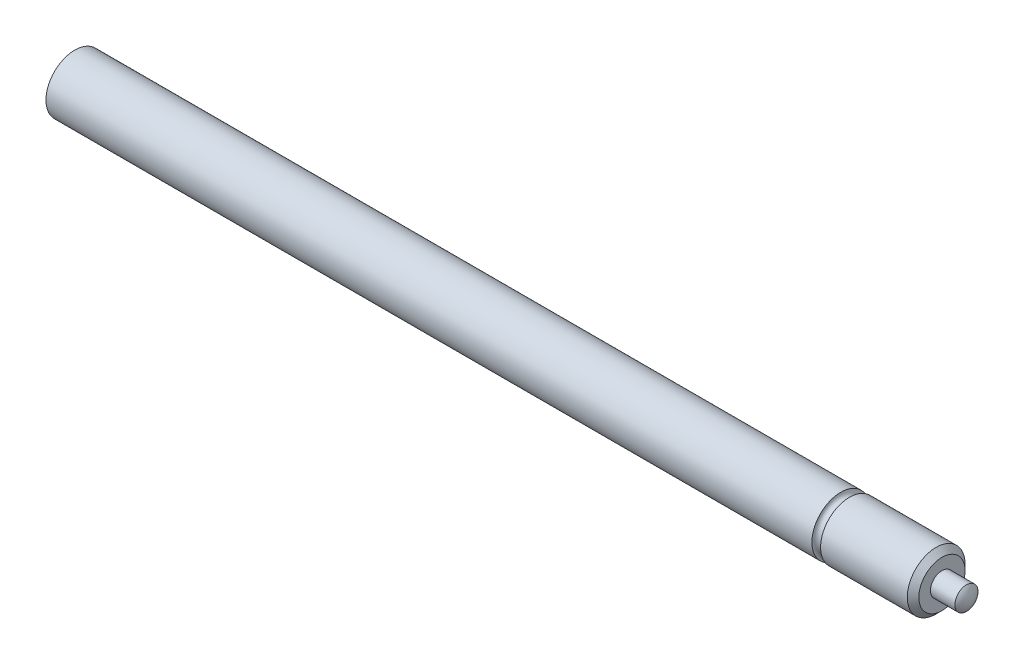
ISO-10303-21;
HEADER;
FILE_DESCRIPTION(('STEP AP214'),'2;1');
FILE_NAME('part.step','',(''),(''),'','','');
FILE_SCHEMA(('AUTOMOTIVE_DESIGN { 1 0 10303 214 1 1 1 1 }'));
ENDSEC;
DATA;
#1=APPLICATION_CONTEXT('core data for automotive mechanical design processes');
#2=APPLICATION_PROTOCOL_DEFINITION('international standard','automotive_design',2000,#1);
#3=PRODUCT_CONTEXT('',#1,'mechanical');
#4=PRODUCT('Part','Part','',(#3));
#5=PRODUCT_RELATED_PRODUCT_CATEGORY('part','',(#4));
#6=PRODUCT_DEFINITION_FORMATION('','',#4);
#7=PRODUCT_DEFINITION_CONTEXT('part definition',#1,'design');
#8=PRODUCT_DEFINITION('design','',#6,#7);
#9=PRODUCT_DEFINITION_SHAPE('','',#8);
#10=(LENGTH_UNIT() NAMED_UNIT(*) SI_UNIT(.MILLI.,.METRE.));
#11=(NAMED_UNIT(*) PLANE_ANGLE_UNIT() SI_UNIT($,.RADIAN.));
#12=(NAMED_UNIT(*) SI_UNIT($,.STERADIAN.) SOLID_ANGLE_UNIT());
#13=UNCERTAINTY_MEASURE_WITH_UNIT(LENGTH_MEASURE(1.E-05),#10,'distance_accuracy_value','');
#14=(GEOMETRIC_REPRESENTATION_CONTEXT(3) GLOBAL_UNCERTAINTY_ASSIGNED_CONTEXT((#13)) GLOBAL_UNIT_ASSIGNED_CONTEXT((#10,
#11,#12)) REPRESENTATION_CONTEXT('',''));
#15=CARTESIAN_POINT('',(0.,0.,0.));
#16=DIRECTION('',(0.,0.,1.));
#17=DIRECTION('',(1.,0.,0.));
#18=AXIS2_PLACEMENT_3D('',#15,#16,#17);
#19=CARTESIAN_POINT('',(150.,0.,0.));
#20=DIRECTION('',(1.,0.,0.));
#21=DIRECTION('',(0.,0.,-1.));
#22=AXIS2_PLACEMENT_3D('',#19,#20,#21);
#23=PLANE('',#22);
#24=CARTESIAN_POINT('',(150.,0.,0.));
#25=DIRECTION('',(1.,0.,0.));
#26=DIRECTION('',(0.,0.,-1.));
#27=AXIS2_PLACEMENT_3D('',#24,#25,#26);
#28=CIRCLE('',#27,4.);
#29=CARTESIAN_POINT('',(150.,0.,-4.));
#30=VERTEX_POINT('',#29);
#31=EDGE_CURVE('E43',#30,#30,#28,.T.);
#32=ORIENTED_EDGE('',*,*,#31,.T.);
#33=EDGE_LOOP('',(#32));
#34=FACE_BOUND('',#33,.T.);
#35=CARTESIAN_POINT('',(150.,0.,0.));
#36=DIRECTION('',(1.,0.,0.));
#37=DIRECTION('',(0.,0.,-1.));
#38=AXIS2_PLACEMENT_3D('',#35,#36,#37);
#39=CIRCLE('',#38,2.);
#40=CARTESIAN_POINT('',(150.,0.,-2.));
#41=VERTEX_POINT('',#40);
#42=EDGE_CURVE('E55',#41,#41,#39,.T.);
#43=ORIENTED_EDGE('',*,*,#42,.F.);
#44=EDGE_LOOP('',(#43));
#45=FACE_BOUND('',#44,.T.);
#46=ADVANCED_FACE('F36',(#34,#45),#23,.T.);
#47=CARTESIAN_POINT('',(150.,0.,0.));
#48=DIRECTION('',(-1.,0.,0.));
#49=DIRECTION('',(0.,0.,1.));
#50=AXIS2_PLACEMENT_3D('',#47,#48,#49);
#51=CYLINDRICAL_SURFACE('',#50,5.);
#52=CARTESIAN_POINT('',(134.,0.,0.));
#53=DIRECTION('',(1.,0.,0.));
#54=DIRECTION('',(0.,0.,-1.));
#55=AXIS2_PLACEMENT_3D('',#52,#53,#54);
#56=CIRCLE('',#55,5.);
#57=CARTESIAN_POINT('',(134.,0.,-5.));
#58=VERTEX_POINT('',#57);
#59=EDGE_CURVE('E58',#58,#58,#56,.T.);
#60=ORIENTED_EDGE('',*,*,#59,.T.);
#61=EDGE_LOOP('',(#60));
#62=FACE_BOUND('',#61,.T.);
#63=CARTESIAN_POINT('',(149.,0.,0.));
#64=DIRECTION('',(1.,0.,0.));
#65=DIRECTION('',(0.,0.,-1.));
#66=AXIS2_PLACEMENT_3D('',#63,#64,#65);
#67=CIRCLE('',#66,5.);
#68=CARTESIAN_POINT('',(149.,0.,-5.));
#69=VERTEX_POINT('',#68);
#70=EDGE_CURVE('E11',#69,#69,#67,.F.);
#71=ORIENTED_EDGE('',*,*,#70,.T.);
#72=EDGE_LOOP('',(#71));
#73=FACE_BOUND('',#72,.T.);
#74=ADVANCED_FACE('F75',(#62,#73),#51,.T.);
#75=CARTESIAN_POINT('',(150.,0.,0.));
#76=DIRECTION('',(-1.,0.,0.));
#77=DIRECTION('',(0.,0.,1.));
#78=AXIS2_PLACEMENT_3D('',#75,#76,#77);
#79=CONICAL_SURFACE('',#78,4.,0.78539816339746);
#80=ORIENTED_EDGE('',*,*,#70,.F.);
#81=EDGE_LOOP('',(#80));
#82=FACE_BOUND('',#81,.T.);
#83=ORIENTED_EDGE('',*,*,#31,.F.);
#84=EDGE_LOOP('',(#83));
#85=FACE_BOUND('',#84,.T.);
#86=ADVANCED_FACE('F38',(#82,#85),#79,.T.);
#87=CARTESIAN_POINT('',(133.25,0.,0.));
#88=DIRECTION('',(1.,0.,0.));
#89=DIRECTION('',(0.,0.,-1.));
#90=AXIS2_PLACEMENT_3D('',#87,#88,#89);
#91=TOROIDAL_SURFACE('',#90,5.,0.750000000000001);
#92=ORIENTED_EDGE('',*,*,#59,.F.);
#93=EDGE_LOOP('',(#92));
#94=FACE_BOUND('',#93,.T.);
#95=CARTESIAN_POINT('',(132.5,0.,0.));
#96=DIRECTION('',(1.,0.,0.));
#97=DIRECTION('',(0.,0.,-1.));
#98=AXIS2_PLACEMENT_3D('',#95,#96,#97);
#99=CIRCLE('',#98,5.);
#100=CARTESIAN_POINT('',(132.5,0.,-5.));
#101=VERTEX_POINT('',#100);
#102=EDGE_CURVE('E63',#101,#101,#99,.T.);
#103=ORIENTED_EDGE('',*,*,#102,.T.);
#104=EDGE_LOOP('',(#103));
#105=FACE_BOUND('',#104,.T.);
#106=ADVANCED_FACE('F74',(#94,#105),#91,.F.);
#107=CARTESIAN_POINT('',(0.,0.,0.));
#108=DIRECTION('',(1.,0.,0.));
#109=DIRECTION('',(0.,0.,-1.));
#110=AXIS2_PLACEMENT_3D('',#107,#108,#109);
#111=PLANE('',#110);
#112=CARTESIAN_POINT('',(0.,0.,0.));
#113=DIRECTION('',(1.,0.,0.));
#114=DIRECTION('',(0.,0.,-1.));
#115=AXIS2_PLACEMENT_3D('',#112,#113,#114);
#116=CIRCLE('',#115,5.);
#117=CARTESIAN_POINT('',(0.,0.,-5.));
#118=VERTEX_POINT('',#117);
#119=EDGE_CURVE('E66',#118,#118,#116,.T.);
#120=ORIENTED_EDGE('',*,*,#119,.F.);
#121=EDGE_LOOP('',(#120));
#122=FACE_BOUND('',#121,.T.);
#123=ADVANCED_FACE('F81',(#122),#111,.F.);
#124=ORIENTED_EDGE('',*,*,#102,.F.);
#125=EDGE_LOOP('',(#124));
#126=FACE_BOUND('',#125,.T.);
#127=ORIENTED_EDGE('',*,*,#119,.T.);
#128=EDGE_LOOP('',(#127));
#129=FACE_BOUND('',#128,.T.);
#130=ADVANCED_FACE('F85',(#126,#129),#51,.T.);
#131=CARTESIAN_POINT('',(155.,0.,0.));
#132=DIRECTION('',(-1.,0.,0.));
#133=DIRECTION('',(0.,0.,1.));
#134=AXIS2_PLACEMENT_3D('',#131,#132,#133);
#135=CYLINDRICAL_SURFACE('',#134,2.);
#136=CARTESIAN_POINT('',(154.2360679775,0.,0.));
#137=DIRECTION('',(1.,0.,0.));
#138=DIRECTION('',(0.,0.,-1.));
#139=AXIS2_PLACEMENT_3D('',#136,#137,#138);
#140=CIRCLE('',#139,2.);
#141=CARTESIAN_POINT('',(154.2360679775,0.,-2.));
#142=VERTEX_POINT('',#141);
#143=EDGE_CURVE('E53',#142,#142,#140,.T.);
#144=ORIENTED_EDGE('',*,*,#143,.F.);
#145=EDGE_LOOP('',(#144));
#146=FACE_BOUND('',#145,.T.);
#147=ORIENTED_EDGE('',*,*,#42,.T.);
#148=EDGE_LOOP('',(#147));
#149=FACE_BOUND('',#148,.T.);
#150=ADVANCED_FACE('F49',(#146,#149),#135,.T.);
#151=CARTESIAN_POINT('',(152.,0.,0.));
#152=DIRECTION('',(1.,0.,0.));
#153=DIRECTION('',(0.,1.,0.));
#154=AXIS2_PLACEMENT_3D('',#151,#152,#153);
#155=SPHERICAL_SURFACE('',#154,3.);
#156=CARTESIAN_POINT('',(155.,0.,0.));
#157=VERTEX_POINT('',#156);
#158=VERTEX_LOOP('',#157);
#159=FACE_BOUND('',#158,.T.);
#160=ORIENTED_EDGE('',*,*,#143,.T.);
#161=EDGE_LOOP('',(#160));
#162=FACE_BOUND('',#161,.T.);
#163=ADVANCED_FACE('F46',(#159,#162),#155,.T.);
#164=CLOSED_SHELL('',(#46,#74,#86,#106,#123,#130,#150,#163));
#165=MANIFOLD_SOLID_BREP('B2',#164);
#166=ADVANCED_BREP_SHAPE_REPRESENTATION('',(#18,#165),#14);
#167=SHAPE_DEFINITION_REPRESENTATION(#9,#166);
ENDSEC;
END-ISO-10303-21;
